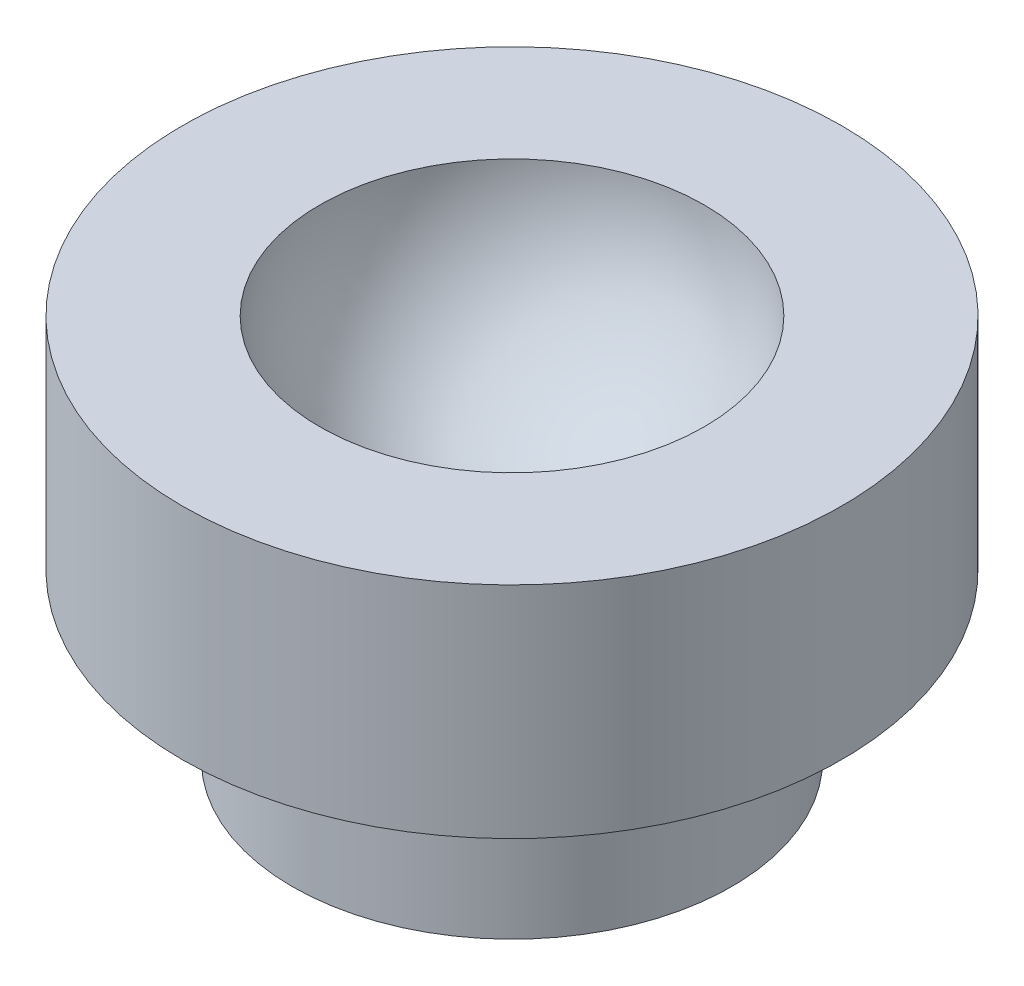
from build123d import *


with BuildPart() as part:
    # Sketch 1 → Revolve 1 (revolve)
    with BuildSketch(Plane.XY, mode=Mode.PRIVATE) as revolve_1_sk:
        Polygon((0, 0), (40, 0), (40, 30), (60, 30), (60, 70), (0, 70), align=None)
    revolve(revolve_1_sk.sketch.rotate(Axis((0, -25.128026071, 0), (0, 1, 0)), 90), axis=Axis((0, -25.128026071, 0), (0, 1, 0)))

    # Sketch 2 → Cut-Revolve 3 (revolve, cut)
    with BuildSketch(Plane.XY):
        with BuildLine():
            Line((34.999875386, 70), (0, 70.093396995))
            Line((0, 70.093396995), (0, 35.093396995))
            ThreePointArc((0, 35.093396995), (24.715694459, 45.311660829), (34.999875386, 70))
        make_face()
    revolve(axis=Axis((0, 14.994435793, 0), (0, 1, 0)), mode=Mode.SUBTRACT)


solid = part.part
